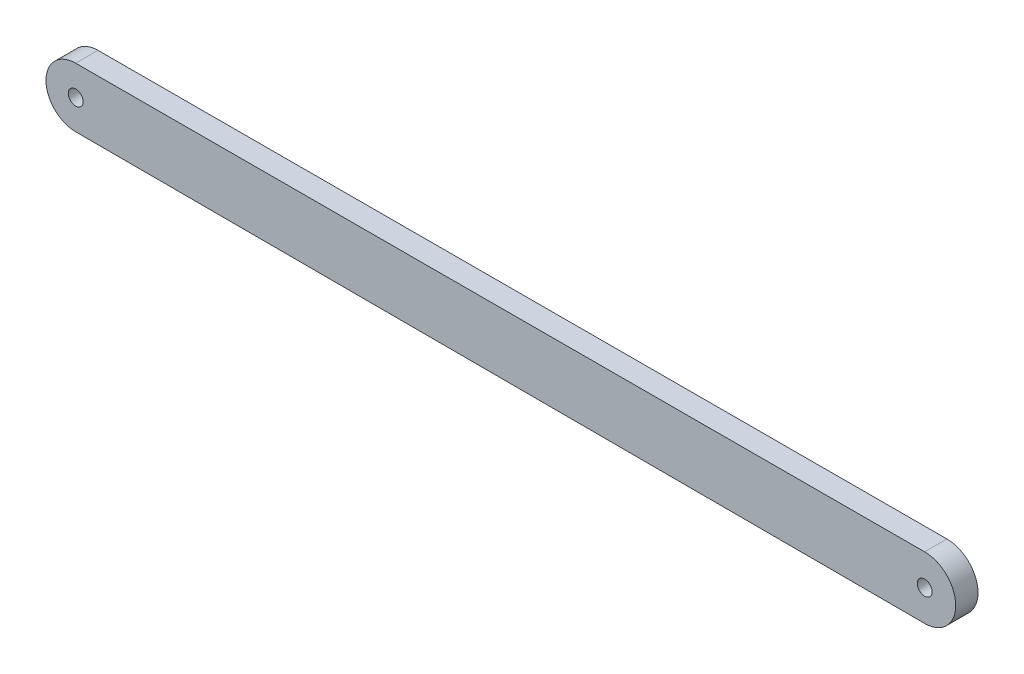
from build123d import *

# Parameters (mm, degrees)
SKETCH1_R           = 1
BOSS_EXTRUDE1_DEPTH = 3


with BuildPart() as part:
    # Sketch1 → Boss-Extrude1 (new body)
    with BuildSketch(Plane.XY):
        with BuildLine():
            Line((-0.006124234, 3.999995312), (114.29360783, 4.174995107))
            ThreePointArc((114.29360783, 4.174995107), (118.475, 0), (114.29360783, -4.174995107))
            Line((114.29360783, -4.174995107), (-0.006124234, -3.999995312))
            ThreePointArc((-0.006124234, -3.999995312), (-4, 0), (-0.006124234, 3.999995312))
        make_face()
        Circle(SKETCH1_R, mode=Mode.SUBTRACT)
        with Locations((114.3, 0)):
            Circle(SKETCH1_R, mode=Mode.SUBTRACT)
    extrude(amount=BOSS_EXTRUDE1_DEPTH)


solid = part.part
